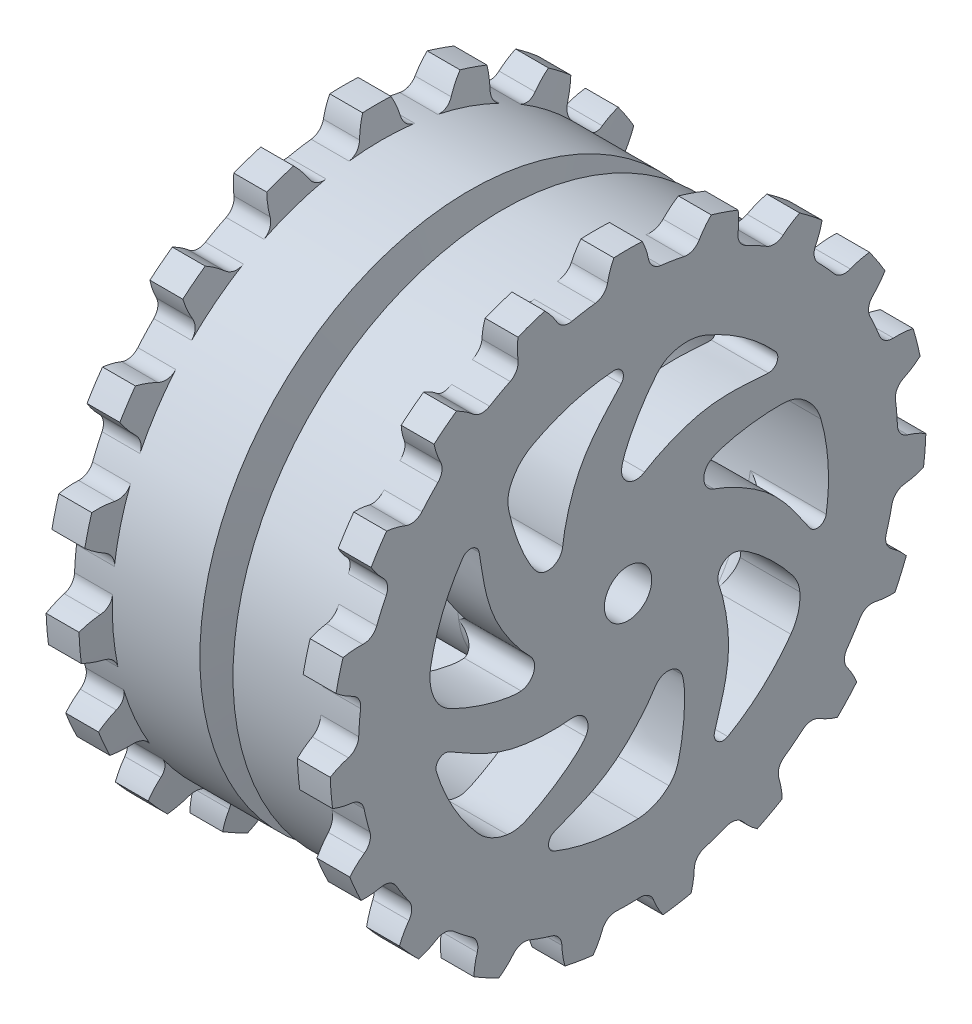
from build123d import *
from build123d.topology import SkipClean

# Parameters (mm, degrees)
ESQUISSE1_R                        = 28.465
BOSS_EXTRU_1_DEPTH                 = 15
BOSS_EXTRU_3_DEPTH                 = 15
CONG_1_R                           = 1.5
R_P_TITION_CIRCULAIRE1_COUNT       = 19
CONG_1_OF_R_P_TITION_CIRCULAIRE1_R = 1.5
ENL_V_MAT_EXTRU_1_DEPTH            = 5
CONG_2_R                           = 2
ENL_V_MAT_EXTRU_2_DEPTH            = 54.655207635
R_P_TITION_CIRCULAIRE2_COUNT       = 7
CONG_3_R                           = 3


with BuildPart() as part:
    # Esquisse1 → Boss.-Extru.1 (new, symmetric)
    with BuildSketch(Plane(origin=(0, 0, 0), x_dir=(0, 0, -1), z_dir=(1, 0, 0))):
        Circle(ESQUISSE1_R)
    extrude(amount=BOSS_EXTRU_1_DEPTH, both=True)

    # Esquisse3 → Boss.-Extru.3 (add, symmetric)
    with BuildSketch(Plane(origin=(0, 0, 0), x_dir=(0, 0, -1), z_dir=(1, 0, 0))):
        with BuildLine():
            ThreePointArc((-2.309549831, 28.371150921), (0, 28.465), (2.309549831, 28.371150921))
            ThreePointArc((2.309549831, 28.371150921), (2.057437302, 29.940601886), (1.5, 31.429225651))
            ThreePointArc((1.5, 31.429225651), (0, 31.465), (-1.5, 31.429225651))
            ThreePointArc((-1.5, 31.429225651), (-2.057437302, 29.940601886), (-2.309549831, 28.371150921))
        make_face()
    boss_extru_3 = extrude(amount=BOSS_EXTRU_3_DEPTH, both=True)

    # Cong_1
    cong_1_edges = [part.edges().sort_by_distance(p)[0] for p in [
        (0, 28.371150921, 2.309549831),
        (0, 28.371150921, -2.309549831),
    ]]
    fillet(cong_1_edges, radius=CONG_1_R)

    # R_p_tition circulaire1: Boss.-Extru.3 ×19 about axis
    r_p_tition_circulaire1_axis = Axis((0, 0, 0), (1, 0, 0))
    for i in range(1, R_P_TITION_CIRCULAIRE1_COUNT):
        add(boss_extru_3.rotate(r_p_tition_circulaire1_axis, i * 360 / R_P_TITION_CIRCULAIRE1_COUNT))

    # Cong_1 of R_p_tition circulaire1
    cong_1_of_r_p_tition_circulaire1_edges = [part.edges().sort_by_distance(p)[0] for p in [
        (0, 26.084014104, 11.396509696),
        (0, 27.583833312, 7.027685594),
        (0, 20.970269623, 19.2484809),
        (0, 23.807379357, 15.603362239),
        (0, 13.584071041, 25.014580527),
        (0, 17.451026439, 22.488172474),
        (0, 4.725827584, 28.069962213),
        (0, 9.203584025, 26.936040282),
        (0, -4.644532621, 28.083527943),
        (0, -0.041209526, 28.46497017),
        (0, -13.511585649, 25.05380766),
        (0, -9.281537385, 26.90927886),
        (0, -20.914448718, 19.309118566),
        (0, -17.516066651, 22.437549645),
        (0, -26.050906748, 11.471986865),
        (0, -23.852458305, 15.534363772),
        (0, -28.36434481, 2.39168738),
        (0, -27.604065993, 6.947788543),
        (0, -27.604065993, -6.947788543),
        (0, -28.36434481, -2.39168738),
        (0, -23.852458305, -15.534363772),
        (0, -26.050906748, -11.471986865),
        (0, -17.516066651, -22.437549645),
        (0, -20.914448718, -19.309118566),
        (0, -9.281537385, -26.90927886),
        (0, -13.511585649, -25.05380766),
        (0, -0.041209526, -28.46497017),
        (0, -4.644532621, -28.083527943),
        (0, 9.203584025, -26.936040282),
        (0, 4.725827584, -28.069962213),
        (0, 17.451026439, -22.488172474),
        (0, 13.584071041, -25.014580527),
        (0, 23.807379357, -15.603362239),
        (0, 20.970269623, -19.2484809),
        (0, 27.583833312, -7.027685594),
        (0, 26.084014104, -11.396509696),
    ]]
    fillet(cong_1_of_r_p_tition_circulaire1_edges, radius=CONG_1_OF_R_P_TITION_CIRCULAIRE1_R)

    # Esquisse4 → Enl_vement de mati_re-R_volution1 (revolve, cut)
    with BuildSketch(Plane.XY, mode=Mode.PRIVATE) as enl_vement_de_mati_re_r_volution1_sk:
        Polygon((11.535152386, 31.5), (-11.535152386, 31.5), (-11, 28.465), (-1.75, 28.465), (-1.145674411, 24.165), (1.145674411, 24.165), (1.75, 28.465), (11, 28.465), align=None)
    revolve(enl_vement_de_mati_re_r_volution1_sk.sketch.rotate(Axis((0, 0, 0), (-1, 0, 0)), 90), axis=Axis((0, 0, 0), (-1, 0, 0)), mode=Mode.SUBTRACT)

    # Esquisse5 → Enl_vement de mati_re-R_volution2 (revolve, cut)
    with BuildSketch(Plane.XY, mode=Mode.PRIVATE) as enl_vement_de_mati_re_r_volution2_sk:
        Polygon((-15, 25), (-6, 25), (-6, 21.165), (9, 21.165), (9, 10), (-3, 10), (-3, 2), (5, 2), (5, 2.5), (15, 2.5), (15, 0), (-15, 0), align=None)
    revolve(enl_vement_de_mati_re_r_volution2_sk.sketch.rotate(Axis((0, 0, 0), (-1, 0, 0)), 90), axis=Axis((0, 0, 0), (-1, 0, 0)), mode=Mode.SUBTRACT)

    # Esquisse6 → Enl_v. mat.-Extru.1 (cut)
    with BuildSketch(Plane.ZY.offset(3)):
        Polygon((7.505553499, 0), (3.75277675, 6.5), (-3.75277675, 6.5), (-7.505553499, 0), (-3.75277675, -6.5), (3.75277675, -6.5), align=None)
    extrude(amount=-ENL_V_MAT_EXTRU_1_DEPTH, mode=Mode.SUBTRACT)

    # Cong_2
    cong_2_edges = [part.edges().sort_by_distance(p)[0] for p in [
        (9, 0, 10),
        (9, 0, 21.165),
    ]]
    fillet(cong_2_edges, radius=CONG_2_R)

    # Esquisse7 → Enl_v. mat.-Extru.2 (cut, through all)
    with SkipClean():  # the faces are left unmerged after this step: merging them gives an invalid solid
        with BuildSketch(Plane(origin=(15, 0, 0), x_dir=(0, 0, -1), z_dir=(1, 0, 0))):
            with BuildLine():
                ThreePointArc((4.67682225, 19.669776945), (6.45457462, 19.904476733), (8.203900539, 19.510336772))
                ThreePointArc((8.203900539, 19.510336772), (12.157907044, 17.324621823), (15.557929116, 14.349497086))
                ThreePointArc((15.557929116, 14.349497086), (15.723642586, 13.300400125), (14.818594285, 12.744564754))
                add(Edge.make_bspline(
                    [(1.737250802, 10.219145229), (2.90172382, 10.97319829), (8.319667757, 13.558266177), (12.891241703, 12.817051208), (14.818594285, 12.744564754)],
                    knots=[0, 0, 0, 0, 0.437500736, 1, 1, 1, 1], degree=3))
                ThreePointArc((1.737250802, 10.219145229), (0.043857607, 10.207976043), (-0.679406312, 11.739182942))
                add(Edge.make_bspline(
                    [(-0.679406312, 11.739182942), (-0.489317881, 13.230600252), (1.700574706, 17.154706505), (3.755118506, 19.376868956), (4.67682225, 19.669776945)],
                    knots=[0, 0, 0, 0, 0.737876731, 1, 1, 1, 1], degree=3))
            make_face()
        enl_v_mat_extru_2 = extrude(amount=-ENL_V_MAT_EXTRU_2_DEPTH, mode=Mode.SUBTRACT)

    # R_p_tition circulaire2: Enl_v. mat.-Extru.2 ×7 about axis
    r_p_tition_circulaire2_axis = Axis((15, 0, 0), (1, 0, 0))
    for i in range(1, R_P_TITION_CIRCULAIRE2_COUNT):
        add(enl_v_mat_extru_2.rotate(r_p_tition_circulaire2_axis, i * 360 / R_P_TITION_CIRCULAIRE2_COUNT), mode=Mode.SUBTRACT)

    # Cong_3
    cong_3_edges = [part.edges().sort_by_distance(p)[0] for p in [
        (-6, 0, 21.165),
    ]]
    fillet(cong_3_edges, radius=CONG_3_R)


solid = part.part
